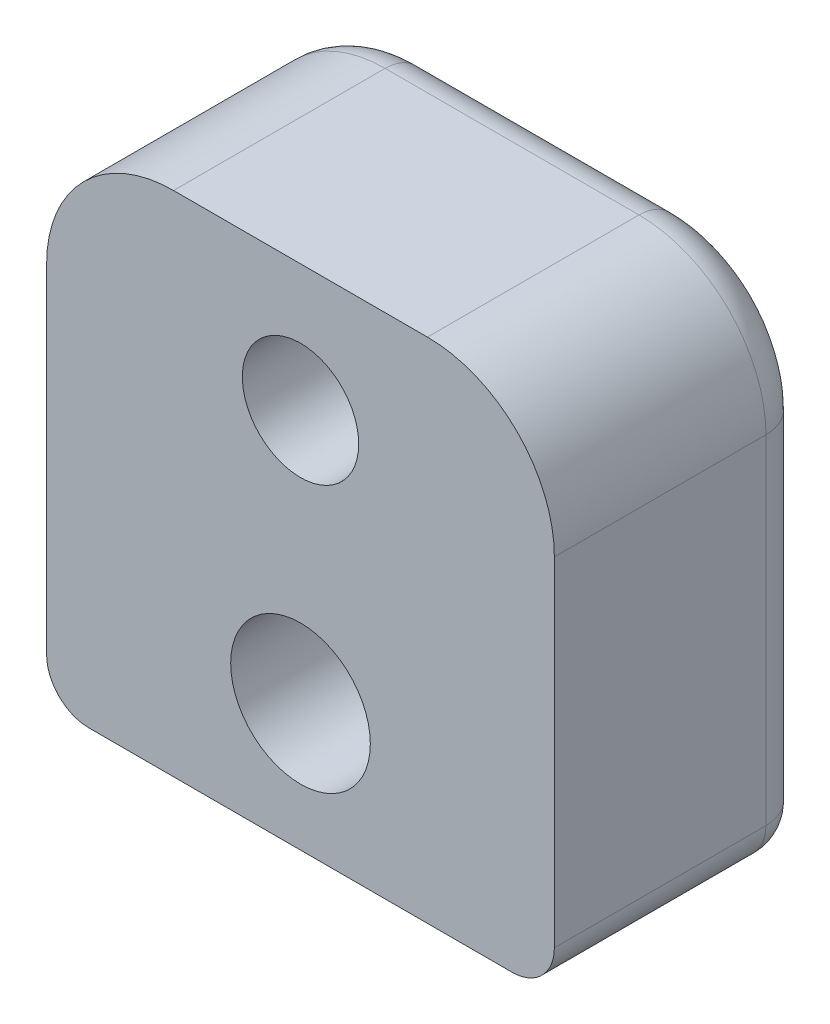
from build123d import *

# Parameters (mm, degrees)
SKETCH1_R           = 3.3
SKETCH1_R_2         = 2.75
BOSS_EXTRUDE1_DEPTH = 12
FILLET1_R           = 2
SKETCH3_R           = 5.5
CUT_EXTRUDE1_DEPTH  = 7


with BuildPart() as part:
    # Sketch1 → Boss-Extrude1 (new body)
    with BuildSketch(Plane.XY):
        with BuildLine():
            Line((-5.1875, 9.8125), (6.8125, 9.8125))
            ThreePointArc((6.8125, 9.8125), (11.055140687, 8.055140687), (12.8125, 3.8125))
            Line((12.8125, 3.8125), (12.8125, -12.1875))
            ThreePointArc((12.8125, -12.1875), (12.226713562, -13.601713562), (10.8125, -14.1875))
            Line((10.8125, -14.1875), (-9.1875, -14.1875))
            ThreePointArc((-9.1875, -14.1875), (-10.601713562, -13.601713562), (-11.1875, -12.1875))
            Line((-11.1875, -12.1875), (-11.1875, 3.8125))
            ThreePointArc((-11.1875, 3.8125), (-9.430140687, 8.055140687), (-5.1875, 9.8125))
        make_face()
        with Locations((0.8125, -8.1875)):
            Circle(SKETCH1_R, mode=Mode.SUBTRACT)
        with Locations((0.8125, 3.8125)):
            Circle(SKETCH1_R_2, mode=Mode.SUBTRACT)
    extrude(amount=BOSS_EXTRUDE1_DEPTH)

    # Fillet1
    fillet1_edges = [part.edges().sort_by_distance(p)[0] for p in [
        (-11.1875, -4.1875, 0),
        (-9.430140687, 8.055140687, 0),
        (0.8125, 9.8125, 0),
        (11.055140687, 8.055140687, 0),
        (12.8125, -4.1875, 0),
        (12.226713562, -13.601713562, 0),
        (0.8125, -14.1875, 0),
        (-10.601713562, -13.601713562, 0),
    ]]
    fillet(fillet1_edges, radius=FILLET1_R)

    # Sketch3 → Cut-Extrude1 (cut)
    with BuildSketch(Plane(origin=(0, 0, 0), x_dir=(-1, 0, 0), z_dir=(0, 0, -1))):
        with Locations((-0.8125, -8.1875)):
            Circle(SKETCH3_R)
    extrude(amount=-CUT_EXTRUDE1_DEPTH, mode=Mode.SUBTRACT)


solid = part.part
